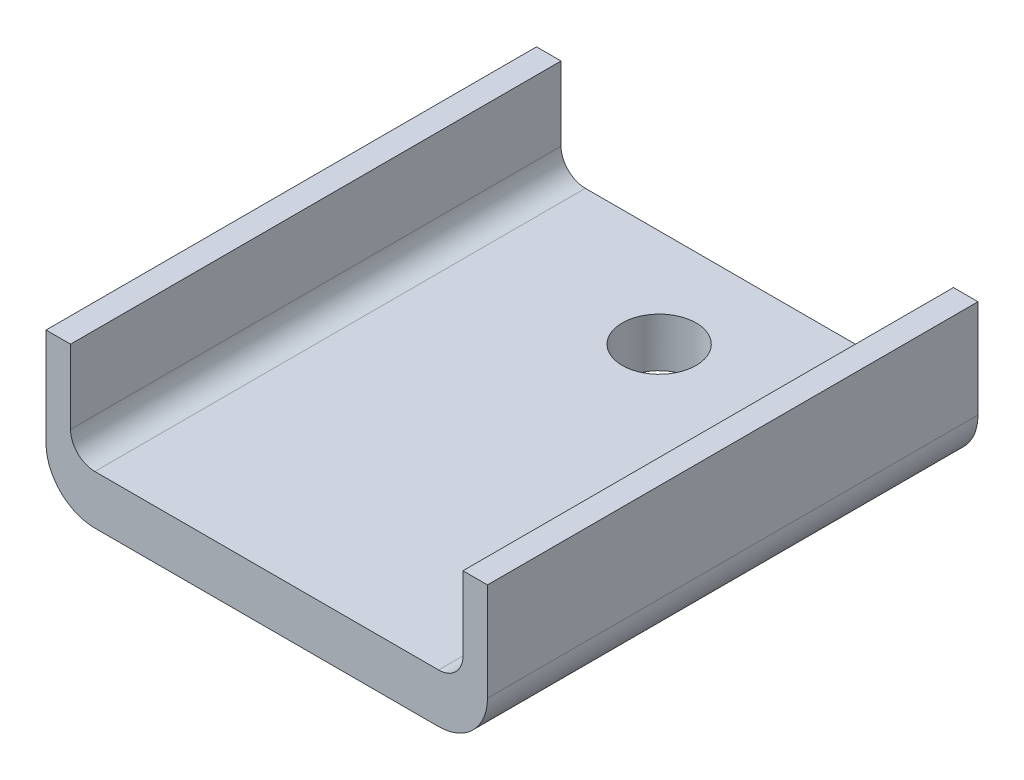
from build123d import *

# Parameters (mm, degrees)
BOSS_EXTRUDE1_DEPTH = 15.875
SKETCH2_R           = 2.3876
CUT_EXTRUDE1_DEPTH  = 12.7
FILLET1_R           = 3.175
FILLET2_R           = 1.5748


with BuildPart() as part:
    # Sketch1 → Boss-Extrude1 (new, symmetric)
    with BuildSketch(Plane.XY):
        Polygon((0, 0), (12.7, 0), (12.7, 6.35), (14.2875, 6.35), (14.2875, -3.175), (-14.2875, -3.175), (-14.2875, 6.35), (-12.7, 6.35), (-12.7, 0), align=None)
    extrude(amount=BOSS_EXTRUDE1_DEPTH, both=True)

    # Sketch2 → Cut-Extrude1 (cut)
    with BuildSketch(Plane(origin=(0, 0, 0), x_dir=(1, 0, 0), z_dir=(0, 1, 0))):
        with Locations(Location((0, 9.525, 0), (0, 0, 270))):
            Circle(SKETCH2_R)
    extrude(amount=-CUT_EXTRUDE1_DEPTH, mode=Mode.SUBTRACT)

    # Fillet1
    fillet1_edges = [part.edges().sort_by_distance(p)[0] for p in [
        (14.2875, -3.175, 0),
        (-14.2875, -3.175, 0),
    ]]
    fillet(fillet1_edges, radius=FILLET1_R)

    # Fillet2
    fillet2_edges = [part.edges().sort_by_distance(p)[0] for p in [
        (12.7, 0, 0),
        (-12.7, 0, 0),
    ]]
    fillet(fillet2_edges, radius=FILLET2_R)


solid = part.part
